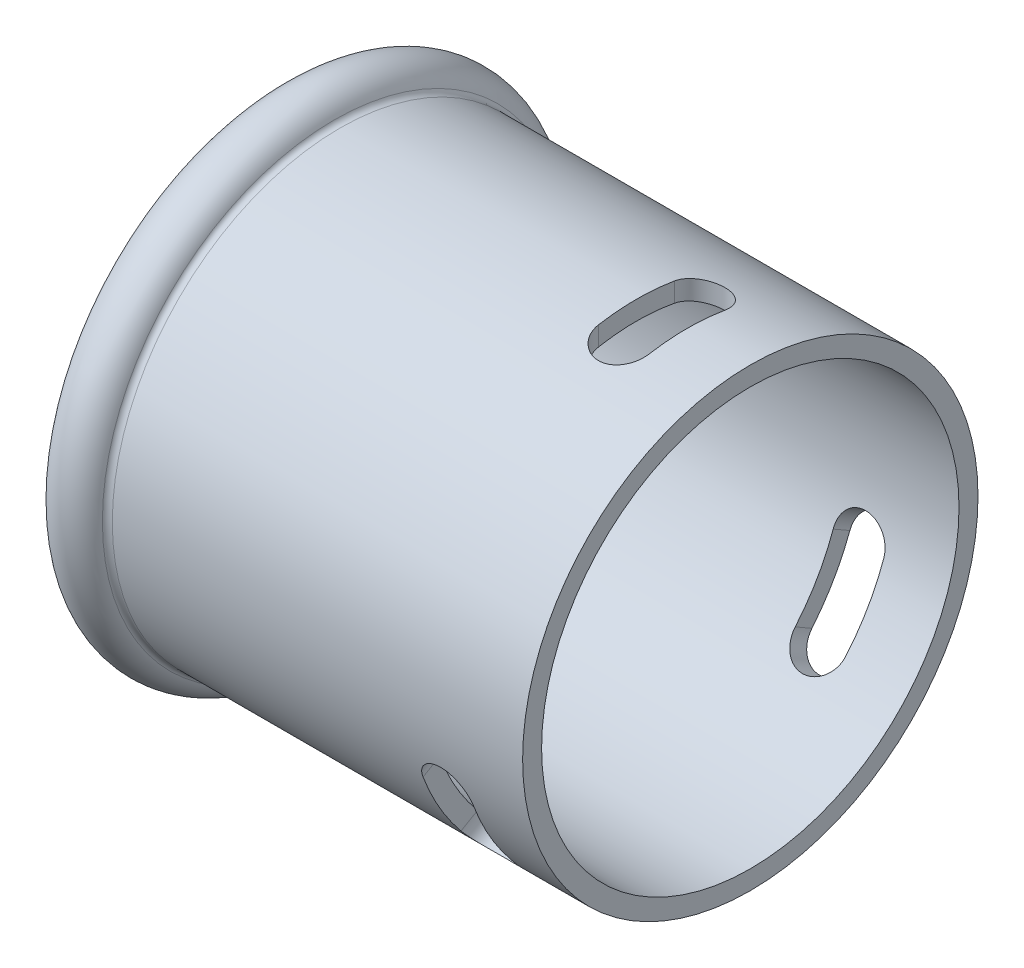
from build123d import *

# Parameters (mm, degrees)
ENL_V_MAT_EXTRU_1_DEPTH      = 20
R_P_TITION_CIRCULAIRE1_COUNT = 3


with BuildPart() as part:
    # Esquisse1 → Base-R_volution (revolve)
    with BuildSketch(Plane.XY, mode=Mode.PRIVATE) as base_r_volution_sk:
        with BuildLine():
            Line((6.945704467, 17.5), (6.945704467, 17))
            Line((6.945704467, 17), (5.445704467, 17))
            Line((5.445704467, 17), (5.445704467, 17.5))
            ThreePointArc((5.445704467, 17.5), (7.279427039, 19.711156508), (9.791671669, 18.318181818))
            ThreePointArc((9.791671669, 18.318181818), (9.975404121, 18.087138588), (10.257442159, 18))
            Line((10.257442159, 18), (42.695704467, 18))
            Line((42.695704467, 18), (42.695704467, 16.5))
            Line((42.695704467, 16.5), (8.841348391, 16.5))
            ThreePointArc((8.841348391, 16.5), (8.423018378, 16.726138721), (8.383090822, 17.2))
            ThreePointArc((8.383090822, 17.2), (7.8489367, 18.234179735), (6.945704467, 17.5))
        make_face()
    revolve(base_r_volution_sk.sketch.rotate(Axis((10.659710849, 0, 0), (1, 0, 0)), 90), axis=Axis((10.659710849, 0, 0), (1, 0, 0)))

    # Esquisse2 → Enl_v. mat.-Extru.1 (cut)
    with BuildSketch(Plane(origin=(0, 0, 0), x_dir=(1, 0, 0), z_dir=(0, 1, 0))):
        with BuildLine():
            Line((33.695704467, -3), (33.695704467, 3))
            ThreePointArc((33.695704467, 3), (35.695704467, 5), (37.695704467, 3))
            Line((37.695704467, 3), (37.695704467, -3))
            ThreePointArc((37.695704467, -3), (35.695704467, -5), (33.695704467, -3))
        make_face()
    enl_v_mat_extru_1 = extrude(amount=ENL_V_MAT_EXTRU_1_DEPTH, mode=Mode.SUBTRACT)

    # R_p_tition circulaire1: Enl_v. mat.-Extru.1 ×3 about axis
    r_p_tition_circulaire1_axis = Axis((10.659710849, 0, 0), (1, 0, 0))
    for i in range(1, R_P_TITION_CIRCULAIRE1_COUNT):
        add(enl_v_mat_extru_1.rotate(r_p_tition_circulaire1_axis, i * 360 / R_P_TITION_CIRCULAIRE1_COUNT), mode=Mode.SUBTRACT)


solid = part.part
